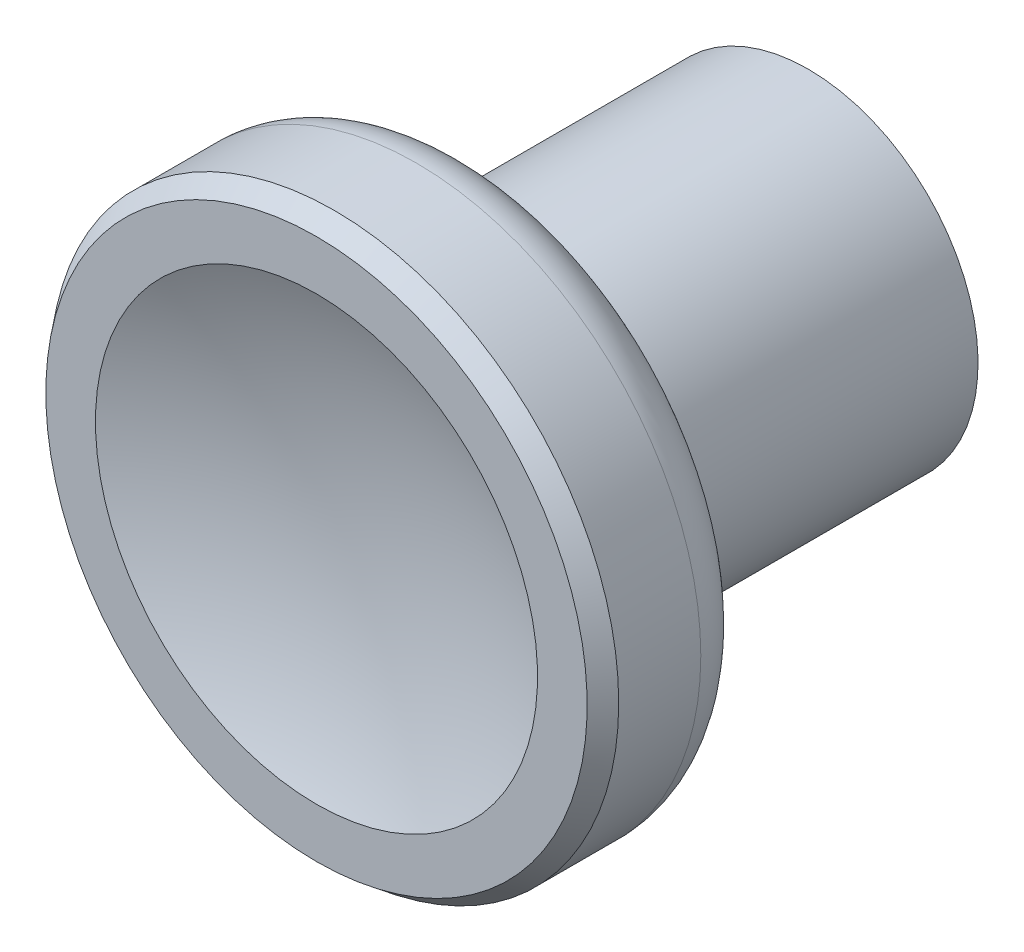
ISO-10303-21;
HEADER;
FILE_DESCRIPTION(('STEP AP214'),'2;1');
FILE_NAME('part.step','',(''),(''),'','','');
FILE_SCHEMA(('AUTOMOTIVE_DESIGN { 1 0 10303 214 1 1 1 1 }'));
ENDSEC;
DATA;
#1=APPLICATION_CONTEXT('core data for automotive mechanical design processes');
#2=APPLICATION_PROTOCOL_DEFINITION('international standard','automotive_design',2000,#1);
#3=PRODUCT_CONTEXT('',#1,'mechanical');
#4=PRODUCT('Part','Part','',(#3));
#5=PRODUCT_RELATED_PRODUCT_CATEGORY('part','',(#4));
#6=PRODUCT_DEFINITION_FORMATION('','',#4);
#7=PRODUCT_DEFINITION_CONTEXT('part definition',#1,'design');
#8=PRODUCT_DEFINITION('design','',#6,#7);
#9=PRODUCT_DEFINITION_SHAPE('','',#8);
#10=(LENGTH_UNIT() NAMED_UNIT(*) SI_UNIT(.MILLI.,.METRE.));
#11=(NAMED_UNIT(*) PLANE_ANGLE_UNIT() SI_UNIT($,.RADIAN.));
#12=(NAMED_UNIT(*) SI_UNIT($,.STERADIAN.) SOLID_ANGLE_UNIT());
#13=UNCERTAINTY_MEASURE_WITH_UNIT(LENGTH_MEASURE(1.E-05),#10,'distance_accuracy_value','');
#14=(GEOMETRIC_REPRESENTATION_CONTEXT(3) GLOBAL_UNCERTAINTY_ASSIGNED_CONTEXT((#13)) GLOBAL_UNIT_ASSIGNED_CONTEXT((#10,
#11,#12)) REPRESENTATION_CONTEXT('',''));
#15=CARTESIAN_POINT('',(0.,0.,0.));
#16=DIRECTION('',(0.,0.,1.));
#17=DIRECTION('',(1.,0.,0.));
#18=AXIS2_PLACEMENT_3D('',#15,#16,#17);
#19=CARTESIAN_POINT('',(9.25,0.,0.2));
#20=DIRECTION('',(0.,0.,1.));
#21=DIRECTION('',(0.,-1.,0.));
#22=AXIS2_PLACEMENT_3D('',#19,#20,#21);
#23=PLANE('',#22);
#24=CARTESIAN_POINT('',(0.,0.,0.2));
#25=DIRECTION('',(0.,0.,-1.));
#26=DIRECTION('',(0.,1.,0.));
#27=AXIS2_PLACEMENT_3D('',#24,#25,#26);
#28=CIRCLE('',#27,5.);
#29=CARTESIAN_POINT('',(0.,5.,0.2));
#30=VERTEX_POINT('',#29);
#31=EDGE_CURVE('E52',#30,#30,#28,.T.);
#32=ORIENTED_EDGE('',*,*,#31,.F.);
#33=EDGE_LOOP('',(#32));
#34=FACE_BOUND('',#33,.T.);
#35=CARTESIAN_POINT('',(0.,0.,0.2));
#36=DIRECTION('',(0.,0.,-1.));
#37=DIRECTION('',(0.,1.,0.));
#38=AXIS2_PLACEMENT_3D('',#35,#36,#37);
#39=CIRCLE('',#38,9.25);
#40=CARTESIAN_POINT('',(0.,9.25,0.2));
#41=VERTEX_POINT('',#40);
#42=EDGE_CURVE('E8',#41,#41,#39,.T.);
#43=ORIENTED_EDGE('',*,*,#42,.T.);
#44=EDGE_LOOP('',(#43));
#45=FACE_BOUND('',#44,.T.);
#46=ADVANCED_FACE('F12',(#34,#45),#23,.F.);
#47=CARTESIAN_POINT('',(0.,0.,-4.9324732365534));
#48=DIRECTION('',(0.,0.,-1.));
#49=DIRECTION('',(0.,1.,0.));
#50=AXIS2_PLACEMENT_3D('',#47,#48,#49);
#51=CYLINDRICAL_SURFACE('',#50,9.25);
#52=CARTESIAN_POINT('',(0.,0.,17.));
#53=DIRECTION('',(0.,0.,-1.));
#54=DIRECTION('',(0.,1.,0.));
#55=AXIS2_PLACEMENT_3D('',#52,#53,#54);
#56=CIRCLE('',#55,9.25);
#57=CARTESIAN_POINT('',(0.,9.25,17.));
#58=VERTEX_POINT('',#57);
#59=EDGE_CURVE('E18',#58,#58,#56,.T.);
#60=ORIENTED_EDGE('',*,*,#59,.T.);
#61=EDGE_LOOP('',(#60));
#62=FACE_BOUND('',#61,.T.);
#63=ORIENTED_EDGE('',*,*,#42,.F.);
#64=EDGE_LOOP('',(#63));
#65=FACE_BOUND('',#64,.T.);
#66=ADVANCED_FACE('F59',(#62,#65),#51,.T.);
#67=CARTESIAN_POINT('',(0.,0.,17.));
#68=DIRECTION('',(0.,0.,-1.));
#69=DIRECTION('',(0.,1.,0.));
#70=AXIS2_PLACEMENT_3D('',#67,#68,#69);
#71=TOROIDAL_SURFACE('',#70,10.0070026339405,0.757002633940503);
#72=ORIENTED_EDGE('',*,*,#59,.F.);
#73=EDGE_LOOP('',(#72));
#74=FACE_BOUND('',#73,.T.);
#75=CARTESIAN_POINT('',(0.,0.,17.7312080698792));
#76=DIRECTION('',(0.,0.,-1.));
#77=DIRECTION('',(0.,1.,0.));
#78=AXIS2_PLACEMENT_3D('',#75,#76,#77);
#79=CIRCLE('',#78,9.81107472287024);
#80=CARTESIAN_POINT('',(0.,9.81107472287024,17.7312080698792));
#81=VERTEX_POINT('',#80);
#82=EDGE_CURVE('E22',#81,#81,#79,.T.);
#83=ORIENTED_EDGE('',*,*,#82,.T.);
#84=EDGE_LOOP('',(#83));
#85=FACE_BOUND('',#84,.T.);
#86=ADVANCED_FACE('F65',(#74,#85),#71,.F.);
#87=CARTESIAN_POINT('',(0.,0.,17.7312080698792));
#88=DIRECTION('',(0.,0.,1.));
#89=DIRECTION('',(0.,-1.,0.));
#90=AXIS2_PLACEMENT_3D('',#87,#88,#89);
#91=CONICAL_SURFACE('',#90,9.81107472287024,1.30899528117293);
#92=CARTESIAN_POINT('',(0.,0.,18.6597619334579));
#93=DIRECTION('',(0.,0.,-1.));
#94=DIRECTION('',(0.,1.,0.));
#95=AXIS2_PLACEMENT_3D('',#92,#93,#94);
#96=CIRCLE('',#95,13.2764619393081);
#97=CARTESIAN_POINT('',(0.,13.2764619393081,18.6597619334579));
#98=VERTEX_POINT('',#97);
#99=EDGE_CURVE('E26',#98,#98,#96,.T.);
#100=ORIENTED_EDGE('',*,*,#99,.T.);
#101=EDGE_LOOP('',(#100));
#102=FACE_BOUND('',#101,.T.);
#103=ORIENTED_EDGE('',*,*,#82,.F.);
#104=EDGE_LOOP('',(#103));
#105=FACE_BOUND('',#104,.T.);
#106=ADVANCED_FACE('F70',(#102,#105),#91,.T.);
#107=CARTESIAN_POINT('',(0.,0.,21.5575381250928));
#108=DIRECTION('',(0.,0.,-1.));
#109=DIRECTION('',(0.,1.,0.));
#110=AXIS2_PLACEMENT_3D('',#107,#108,#109);
#111=TOROIDAL_SURFACE('',#110,12.5,3.);
#112=CARTESIAN_POINT('',(0.,0.,21.5575381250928));
#113=DIRECTION('',(0.,0.,-1.));
#114=DIRECTION('',(0.,1.,0.));
#115=AXIS2_PLACEMENT_3D('',#112,#113,#114);
#116=CIRCLE('',#115,15.5);
#117=CARTESIAN_POINT('',(0.,15.5,21.5575381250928));
#118=VERTEX_POINT('',#117);
#119=EDGE_CURVE('E31',#118,#118,#116,.T.);
#120=ORIENTED_EDGE('',*,*,#119,.T.);
#121=EDGE_LOOP('',(#120));
#122=FACE_BOUND('',#121,.T.);
#123=ORIENTED_EDGE('',*,*,#99,.F.);
#124=EDGE_LOOP('',(#123));
#125=FACE_BOUND('',#124,.T.);
#126=ADVANCED_FACE('F77',(#122,#125),#111,.T.);
#127=CARTESIAN_POINT('',(0.,0.,-4.9324732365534));
#128=DIRECTION('',(0.,0.,-1.));
#129=DIRECTION('',(0.,1.,0.));
#130=AXIS2_PLACEMENT_3D('',#127,#128,#129);
#131=CYLINDRICAL_SURFACE('',#130,15.5);
#132=CARTESIAN_POINT('',(0.,0.,26.0301314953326));
#133=DIRECTION('',(0.,0.,-1.));
#134=DIRECTION('',(0.,1.,0.));
#135=AXIS2_PLACEMENT_3D('',#132,#133,#134);
#136=CIRCLE('',#135,15.5);
#137=CARTESIAN_POINT('',(0.,15.5,26.0301314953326));
#138=VERTEX_POINT('',#137);
#139=EDGE_CURVE('E34',#138,#138,#136,.T.);
#140=ORIENTED_EDGE('',*,*,#139,.T.);
#141=EDGE_LOOP('',(#140));
#142=FACE_BOUND('',#141,.T.);
#143=ORIENTED_EDGE('',*,*,#119,.F.);
#144=EDGE_LOOP('',(#143));
#145=FACE_BOUND('',#144,.T.);
#146=ADVANCED_FACE('F81',(#142,#145),#131,.T.);
#147=CARTESIAN_POINT('',(0.,0.,27.));
#148=DIRECTION('',(0.,0.,-1.));
#149=DIRECTION('',(0.,1.,0.));
#150=AXIS2_PLACEMENT_3D('',#147,#148,#149);
#151=CONICAL_SURFACE('',#150,14.7507565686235,0.657759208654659);
#152=ORIENTED_EDGE('',*,*,#139,.F.);
#153=EDGE_LOOP('',(#152));
#154=FACE_BOUND('',#153,.T.);
#155=CARTESIAN_POINT('',(0.,0.,27.));
#156=DIRECTION('',(0.,0.,-1.));
#157=DIRECTION('',(0.,1.,0.));
#158=AXIS2_PLACEMENT_3D('',#155,#156,#157);
#159=CIRCLE('',#158,14.7507565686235);
#160=CARTESIAN_POINT('',(0.,14.7507565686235,27.));
#161=VERTEX_POINT('',#160);
#162=EDGE_CURVE('E37',#161,#161,#159,.T.);
#163=ORIENTED_EDGE('',*,*,#162,.T.);
#164=EDGE_LOOP('',(#163));
#165=FACE_BOUND('',#164,.T.);
#166=ADVANCED_FACE('F85',(#154,#165),#151,.T.);
#167=CARTESIAN_POINT('',(14.7507565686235,0.,27.));
#168=DIRECTION('',(0.,0.,1.));
#169=DIRECTION('',(0.,-1.,0.));
#170=AXIS2_PLACEMENT_3D('',#167,#168,#169);
#171=PLANE('',#170);
#172=CARTESIAN_POINT('',(0.,0.,27.));
#173=DIRECTION('',(0.,0.,-1.));
#174=DIRECTION('',(0.,1.,0.));
#175=AXIS2_PLACEMENT_3D('',#172,#173,#174);
#176=CIRCLE('',#175,12.0457822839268);
#177=CARTESIAN_POINT('',(0.,12.0457822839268,27.));
#178=VERTEX_POINT('',#177);
#179=EDGE_CURVE('E40',#178,#178,#176,.T.);
#180=ORIENTED_EDGE('',*,*,#179,.T.);
#181=EDGE_LOOP('',(#180));
#182=FACE_BOUND('',#181,.T.);
#183=ORIENTED_EDGE('',*,*,#162,.F.);
#184=EDGE_LOOP('',(#183));
#185=FACE_BOUND('',#184,.T.);
#186=ADVANCED_FACE('F89',(#182,#185),#171,.T.);
#187=CARTESIAN_POINT('',(0.,0.,54.5624551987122));
#188=DIRECTION('',(0.,-1.,0.));
#189=DIRECTION('',(1.,0.,0.));
#190=AXIS2_PLACEMENT_3D('',#187,#188,#189);
#191=SPHERICAL_SURFACE('',#190,30.0797241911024);
#192=CARTESIAN_POINT('',(0.,0.,54.5624551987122));
#193=DIRECTION('',(0.,0.,-1.));
#194=DIRECTION('',(0.,1.,0.));
#195=AXIS2_PLACEMENT_3D('',#192,#193,#194);
#196=SPHERICAL_SURFACE('',#195,30.0797241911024);
#197=ORIENTED_EDGE('',*,*,#179,.F.);
#198=EDGE_LOOP('',(#197));
#199=FACE_BOUND('',#198,.T.);
#200=ADVANCED_FACE('F93',(#199),#196,.F.);
#201=CARTESIAN_POINT('',(4.,0.,15.));
#202=DIRECTION('',(0.,0.,1.));
#203=DIRECTION('',(0.,-1.,0.));
#204=AXIS2_PLACEMENT_3D('',#201,#202,#203);
#205=PLANE('',#204);
#206=CARTESIAN_POINT('',(0.,0.,15.));
#207=DIRECTION('',(0.,0.,-1.));
#208=DIRECTION('',(0.,1.,0.));
#209=AXIS2_PLACEMENT_3D('',#206,#207,#208);
#210=CIRCLE('',#209,4.);
#211=CARTESIAN_POINT('',(0.,4.,15.));
#212=VERTEX_POINT('',#211);
#213=EDGE_CURVE('E43',#212,#212,#210,.T.);
#214=ORIENTED_EDGE('',*,*,#213,.T.);
#215=EDGE_LOOP('',(#214));
#216=FACE_BOUND('',#215,.T.);
#217=ADVANCED_FACE('F97',(#216),#205,.F.);
#218=CARTESIAN_POINT('',(0.,0.,-4.9324732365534));
#219=DIRECTION('',(0.,0.,-1.));
#220=DIRECTION('',(0.,1.,0.));
#221=AXIS2_PLACEMENT_3D('',#218,#219,#220);
#222=CYLINDRICAL_SURFACE('',#221,4.);
#223=ORIENTED_EDGE('',*,*,#213,.F.);
#224=EDGE_LOOP('',(#223));
#225=FACE_BOUND('',#224,.T.);
#226=CARTESIAN_POINT('',(0.,0.,0.));
#227=DIRECTION('',(0.,0.,-1.));
#228=DIRECTION('',(0.,1.,0.));
#229=AXIS2_PLACEMENT_3D('',#226,#227,#228);
#230=CIRCLE('',#229,4.);
#231=CARTESIAN_POINT('',(0.,4.,0.));
#232=VERTEX_POINT('',#231);
#233=EDGE_CURVE('E46',#232,#232,#230,.T.);
#234=ORIENTED_EDGE('',*,*,#233,.T.);
#235=EDGE_LOOP('',(#234));
#236=FACE_BOUND('',#235,.T.);
#237=ADVANCED_FACE('F101',(#225,#236),#222,.F.);
#238=CARTESIAN_POINT('',(4.99999999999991,0.,0.));
#239=DIRECTION('',(0.,0.,1.));
#240=DIRECTION('',(0.,-1.,0.));
#241=AXIS2_PLACEMENT_3D('',#238,#239,#240);
#242=PLANE('',#241);
#243=ORIENTED_EDGE('',*,*,#233,.F.);
#244=EDGE_LOOP('',(#243));
#245=FACE_BOUND('',#244,.T.);
#246=CARTESIAN_POINT('',(0.,0.,0.));
#247=DIRECTION('',(0.,0.,-1.));
#248=DIRECTION('',(0.,1.,0.));
#249=AXIS2_PLACEMENT_3D('',#246,#247,#248);
#250=CIRCLE('',#249,5.);
#251=CARTESIAN_POINT('',(0.,5.,0.));
#252=VERTEX_POINT('',#251);
#253=EDGE_CURVE('E49',#252,#252,#250,.T.);
#254=ORIENTED_EDGE('',*,*,#253,.T.);
#255=EDGE_LOOP('',(#254));
#256=FACE_BOUND('',#255,.T.);
#257=ADVANCED_FACE('F105',(#245,#256),#242,.F.);
#258=CARTESIAN_POINT('',(0.,0.,-4.9324732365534));
#259=DIRECTION('',(0.,0.,-1.));
#260=DIRECTION('',(0.,1.,0.));
#261=AXIS2_PLACEMENT_3D('',#258,#259,#260);
#262=CYLINDRICAL_SURFACE('',#261,5.);
#263=ORIENTED_EDGE('',*,*,#253,.F.);
#264=EDGE_LOOP('',(#263));
#265=FACE_BOUND('',#264,.T.);
#266=ORIENTED_EDGE('',*,*,#31,.T.);
#267=EDGE_LOOP('',(#266));
#268=FACE_BOUND('',#267,.T.);
#269=ADVANCED_FACE('F56',(#265,#268),#262,.T.);
#270=CLOSED_SHELL('',(#46,#66,#86,#106,#126,#146,#166,#186,#200,#217,#237,#257,#269));
#271=MANIFOLD_SOLID_BREP('B1',#270);
#272=ADVANCED_BREP_SHAPE_REPRESENTATION('',(#18,#271),#14);
#273=SHAPE_DEFINITION_REPRESENTATION(#9,#272);
ENDSEC;
END-ISO-10303-21;
